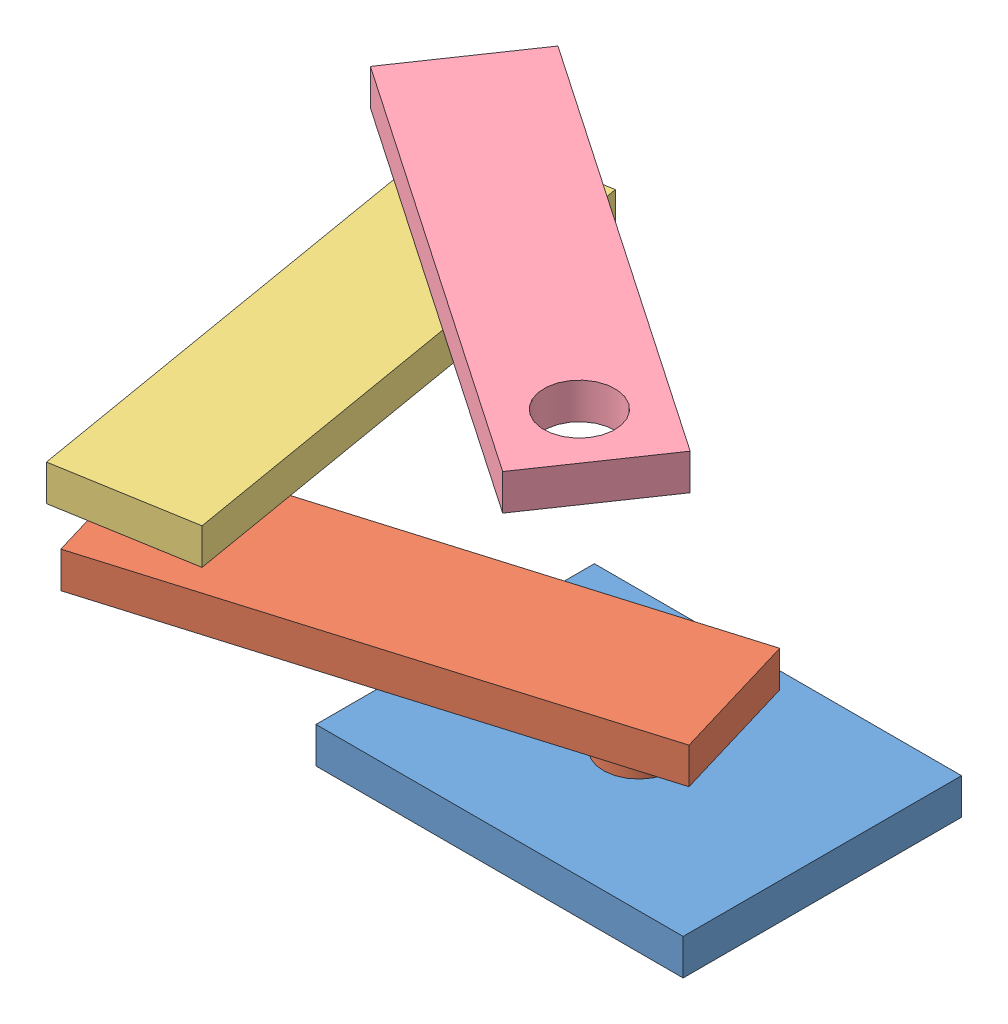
SolidWorks assembly Baugruppe1.sldasm, configuration Standard (file format 4100). Lengths in mm.
Overall size (192.59 70 151.03).
4 component instances, 4 part files, 8 mates.
Components (placement in the parent):
- Bsp-1-1: Bsp-1.SLDPRT [Standard] at origin size (101.94 10 77.3)
- Bsp-2-1: Bsp-2.SLDPRT [Standard] at (0 10 0) x (-0.958297 0 0.285776) z (-0.285776 0 -0.958297) size (140.19 20 37.46)
- Bsp-3-1: Bsp-3.SLDPRT [Standard] at (-96.5768 30 28.8004) x (-0.167308 0 -0.985905) z (0.985905 0 -0.167308) size (140.19 20 37.46)
- Bsp-4-1: Bsp-4.SLDPRT [Standard] at (-113.4381 50 -70.5588) x (0.825832 0 0.563916) z (-0.563916 0 0.825832) size (140.19 20 37.46)
Mates (geometry in assembly coordinates):
- Konzentrisch1: concentric anti-aligned: cylinder of Bsp-1-1 through (0 0 0) axis (0 1 0) radius 9.5128; cylinder of Bsp-2-1 through (0 20 0) axis (0 -1 0) radius 9.87
- Deckungsgleich1: coincident anti-aligned: plane of Bsp-1-1 through (50.9722 10 38.6478) normal (0 1 0); plane of Bsp-2-1 through (0 10 0) normal (0 -1 0)
- Konzentrisch2: concentric anti-aligned: cylinder of Bsp-2-1 through (-96.5768 20 28.8004) axis (0 1 0) radius 9.87; cylinder of Bsp-3-1 through (-96.5768 40 28.8004) axis (0 -1 0) radius 9.87
- Deckungsgleich2: coincident anti-aligned: plane of Bsp-2-1 through (15.0973 30 -24.0462) normal (0 1 0); plane of Bsp-3-1 through (-96.5768 30 28.8004) normal (0 -1 0)
- Konzentrisch3: concentric anti-aligned: cylinder of Bsp-3-1 through (-113.4381 40 -70.5588) axis (0 1 0) radius 9.87; cylinder of Bsp-4-1 through (-113.4381 60 -70.5588) axis (0 -1 0) radius 9.87
- Deckungsgleich3: coincident anti-aligned: plane of Bsp-3-1 through (-74.5416 50 46.7056) normal (0 1 0); plane of Bsp-4-1 through (-113.4381 50 -70.5588) normal (0 -1 0)
- Zahnradverknüpfung1: gear = 1 mm: cylinder of Bsp-1-1 through (0 0 0) axis (0 1 0) radius 9.5128; cylinder of Bsp-3-1 through (-96.5768 40 28.8004) axis (0 -1 0) radius 9.87
- Zahnradverknüpfung2: gear = 19.74 mm: cylinder of Bsp-4-1 through (-113.4381 60 -70.5588) axis (0 -1 0) radius 9.87; cylinder of Bsp-2-1 through (-96.5768 20 28.8004) axis (0 1 0) radius 9.87
